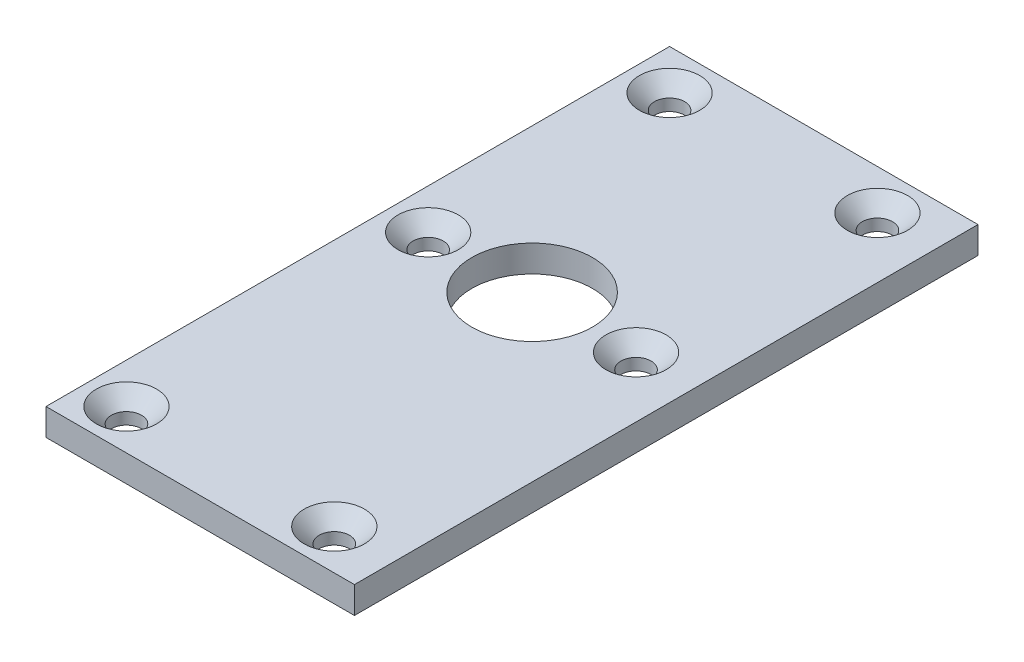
ISO-10303-21;
HEADER;
FILE_DESCRIPTION(('STEP AP214'),'2;1');
FILE_NAME('part.step','',(''),(''),'','','');
FILE_SCHEMA(('AUTOMOTIVE_DESIGN { 1 0 10303 214 1 1 1 1 }'));
ENDSEC;
DATA;
#1=APPLICATION_CONTEXT('core data for automotive mechanical design processes');
#2=APPLICATION_PROTOCOL_DEFINITION('international standard','automotive_design',2000,#1);
#3=PRODUCT_CONTEXT('',#1,'mechanical');
#4=PRODUCT('Part','Part','',(#3));
#5=PRODUCT_RELATED_PRODUCT_CATEGORY('part','',(#4));
#6=PRODUCT_DEFINITION_FORMATION('','',#4);
#7=PRODUCT_DEFINITION_CONTEXT('part definition',#1,'design');
#8=PRODUCT_DEFINITION('design','',#6,#7);
#9=PRODUCT_DEFINITION_SHAPE('','',#8);
#10=(LENGTH_UNIT() NAMED_UNIT(*) SI_UNIT(.MILLI.,.METRE.));
#11=(NAMED_UNIT(*) PLANE_ANGLE_UNIT() SI_UNIT($,.RADIAN.));
#12=(NAMED_UNIT(*) SI_UNIT($,.STERADIAN.) SOLID_ANGLE_UNIT());
#13=UNCERTAINTY_MEASURE_WITH_UNIT(LENGTH_MEASURE(1.E-05),#10,'distance_accuracy_value','');
#14=(GEOMETRIC_REPRESENTATION_CONTEXT(3) GLOBAL_UNCERTAINTY_ASSIGNED_CONTEXT((#13)) GLOBAL_UNIT_ASSIGNED_CONTEXT((#10,
#11,#12)) REPRESENTATION_CONTEXT('',''));
#15=CARTESIAN_POINT('',(0.,0.,0.));
#16=DIRECTION('',(0.,0.,1.));
#17=DIRECTION('',(1.,0.,0.));
#18=AXIS2_PLACEMENT_3D('',#15,#16,#17);
#19=CARTESIAN_POINT('',(-15.5,4.00000000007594,-40.5));
#20=DIRECTION('',(0.,1.,0.));
#21=DIRECTION('',(0.,0.,1.));
#22=AXIS2_PLACEMENT_3D('',#19,#20,#21);
#23=CONICAL_SURFACE('',#22,4.49999999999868,0.785398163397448);
#24=CARTESIAN_POINT('',(-15.5,1.75,-40.5));
#25=DIRECTION('',(0.,1.,0.));
#26=DIRECTION('',(0.,0.,1.));
#27=AXIS2_PLACEMENT_3D('',#24,#25,#26);
#28=CIRCLE('',#27,2.25);
#29=CARTESIAN_POINT('',(-15.5,1.75,-38.25));
#30=VERTEX_POINT('',#29);
#31=EDGE_CURVE('E96',#30,#30,#28,.F.);
#32=ORIENTED_EDGE('',*,*,#31,.T.);
#33=EDGE_LOOP('',(#32));
#34=FACE_BOUND('',#33,.T.);
#35=CARTESIAN_POINT('',(-15.5,4.00000000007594,-40.5));
#36=DIRECTION('',(0.,1.,0.));
#37=DIRECTION('',(0.,0.,1.));
#38=AXIS2_PLACEMENT_3D('',#35,#36,#37);
#39=CIRCLE('',#38,4.49999999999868);
#40=CARTESIAN_POINT('',(-15.5,4.00000000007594,-36.0000000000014));
#41=VERTEX_POINT('',#40);
#42=EDGE_CURVE('E20',#41,#41,#39,.F.);
#43=ORIENTED_EDGE('',*,*,#42,.F.);
#44=EDGE_LOOP('',(#43));
#45=FACE_BOUND('',#44,.T.);
#46=ADVANCED_FACE('F17',(#34,#45),#23,.F.);
#47=CARTESIAN_POINT('',(15.5000000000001,4.0000000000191,-40.5));
#48=DIRECTION('',(0.,1.,0.));
#49=DIRECTION('',(0.,0.,1.));
#50=AXIS2_PLACEMENT_3D('',#47,#48,#49);
#51=CONICAL_SURFACE('',#50,4.49999999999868,0.785398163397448);
#52=CARTESIAN_POINT('',(15.5000000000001,1.75,-40.5));
#53=DIRECTION('',(0.,1.,0.));
#54=DIRECTION('',(0.,0.,1.));
#55=AXIS2_PLACEMENT_3D('',#52,#53,#54);
#56=CIRCLE('',#55,2.25);
#57=CARTESIAN_POINT('',(15.5000000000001,1.75,-38.25));
#58=VERTEX_POINT('',#57);
#59=EDGE_CURVE('E93',#58,#58,#56,.F.);
#60=ORIENTED_EDGE('',*,*,#59,.T.);
#61=EDGE_LOOP('',(#60));
#62=FACE_BOUND('',#61,.T.);
#63=CARTESIAN_POINT('',(15.5000000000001,4.0000000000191,-40.5));
#64=DIRECTION('',(0.,1.,0.));
#65=DIRECTION('',(0.,0.,1.));
#66=AXIS2_PLACEMENT_3D('',#63,#64,#65);
#67=CIRCLE('',#66,4.49999999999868);
#68=CARTESIAN_POINT('',(15.5000000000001,4.0000000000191,-36.0000000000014));
#69=VERTEX_POINT('',#68);
#70=EDGE_CURVE('E135',#69,#69,#67,.F.);
#71=ORIENTED_EDGE('',*,*,#70,.F.);
#72=EDGE_LOOP('',(#71));
#73=FACE_BOUND('',#72,.T.);
#74=ADVANCED_FACE('F145',(#62,#73),#51,.F.);
#75=CARTESIAN_POINT('',(-15.5,4.00000000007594,-4.50000000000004));
#76=DIRECTION('',(0.,1.,0.));
#77=DIRECTION('',(0.,0.,1.));
#78=AXIS2_PLACEMENT_3D('',#75,#76,#77);
#79=CONICAL_SURFACE('',#78,4.50000000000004,0.785398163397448);
#80=CARTESIAN_POINT('',(-15.5,1.75,-4.50000000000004));
#81=DIRECTION('',(0.,1.,0.));
#82=DIRECTION('',(0.,0.,1.));
#83=AXIS2_PLACEMENT_3D('',#80,#81,#82);
#84=CIRCLE('',#83,2.24999999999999);
#85=CARTESIAN_POINT('',(-15.5,1.75,-2.25000000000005));
#86=VERTEX_POINT('',#85);
#87=EDGE_CURVE('E90',#86,#86,#84,.F.);
#88=ORIENTED_EDGE('',*,*,#87,.T.);
#89=EDGE_LOOP('',(#88));
#90=FACE_BOUND('',#89,.T.);
#91=CARTESIAN_POINT('',(-15.5,4.00000000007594,-4.50000000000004));
#92=DIRECTION('',(0.,1.,0.));
#93=DIRECTION('',(0.,0.,1.));
#94=AXIS2_PLACEMENT_3D('',#91,#92,#93);
#95=CIRCLE('',#94,4.50000000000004);
#96=CARTESIAN_POINT('',(-15.5,4.00000000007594,0.));
#97=VERTEX_POINT('',#96);
#98=EDGE_CURVE('E133',#97,#97,#95,.F.);
#99=ORIENTED_EDGE('',*,*,#98,.F.);
#100=EDGE_LOOP('',(#99));
#101=FACE_BOUND('',#100,.T.);
#102=ADVANCED_FACE('F151',(#90,#101),#79,.F.);
#103=CARTESIAN_POINT('',(15.5000000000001,4.00000000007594,-4.50000000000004));
#104=DIRECTION('',(0.,1.,0.));
#105=DIRECTION('',(0.,0.,1.));
#106=AXIS2_PLACEMENT_3D('',#103,#104,#105);
#107=CONICAL_SURFACE('',#106,4.50000000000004,0.785398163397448);
#108=CARTESIAN_POINT('',(15.5000000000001,1.75,-4.50000000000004));
#109=DIRECTION('',(0.,1.,0.));
#110=DIRECTION('',(0.,0.,1.));
#111=AXIS2_PLACEMENT_3D('',#108,#109,#110);
#112=CIRCLE('',#111,2.24999999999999);
#113=CARTESIAN_POINT('',(15.5000000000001,1.75,-2.25000000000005));
#114=VERTEX_POINT('',#113);
#115=EDGE_CURVE('E87',#114,#114,#112,.F.);
#116=ORIENTED_EDGE('',*,*,#115,.T.);
#117=EDGE_LOOP('',(#116));
#118=FACE_BOUND('',#117,.T.);
#119=CARTESIAN_POINT('',(15.5000000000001,4.00000000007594,-4.50000000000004));
#120=DIRECTION('',(0.,1.,0.));
#121=DIRECTION('',(0.,0.,1.));
#122=AXIS2_PLACEMENT_3D('',#119,#120,#121);
#123=CIRCLE('',#122,4.50000000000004);
#124=CARTESIAN_POINT('',(15.5000000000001,4.00000000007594,0.));
#125=VERTEX_POINT('',#124);
#126=EDGE_CURVE('E130',#125,#125,#123,.F.);
#127=ORIENTED_EDGE('',*,*,#126,.F.);
#128=EDGE_LOOP('',(#127));
#129=FACE_BOUND('',#128,.T.);
#130=ADVANCED_FACE('F210',(#118,#129),#107,.F.);
#131=CARTESIAN_POINT('',(-15.5,4.0000000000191,40.4999999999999));
#132=DIRECTION('',(0.,1.,0.));
#133=DIRECTION('',(0.,0.,1.));
#134=AXIS2_PLACEMENT_3D('',#131,#132,#133);
#135=CONICAL_SURFACE('',#134,4.49999999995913,0.785398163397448);
#136=CARTESIAN_POINT('',(-15.5,1.75,40.4999999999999));
#137=DIRECTION('',(0.,1.,0.));
#138=DIRECTION('',(0.,0.,1.));
#139=AXIS2_PLACEMENT_3D('',#136,#137,#138);
#140=CIRCLE('',#139,2.25);
#141=CARTESIAN_POINT('',(-15.5,1.75,42.7499999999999));
#142=VERTEX_POINT('',#141);
#143=EDGE_CURVE('E84',#142,#142,#140,.F.);
#144=ORIENTED_EDGE('',*,*,#143,.T.);
#145=EDGE_LOOP('',(#144));
#146=FACE_BOUND('',#145,.T.);
#147=CARTESIAN_POINT('',(-15.5,4.0000000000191,40.4999999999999));
#148=DIRECTION('',(0.,1.,0.));
#149=DIRECTION('',(0.,0.,1.));
#150=AXIS2_PLACEMENT_3D('',#147,#148,#149);
#151=CIRCLE('',#150,4.49999999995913);
#152=CARTESIAN_POINT('',(-15.5,4.0000000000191,44.9999999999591));
#153=VERTEX_POINT('',#152);
#154=EDGE_CURVE('E127',#153,#153,#151,.F.);
#155=ORIENTED_EDGE('',*,*,#154,.F.);
#156=EDGE_LOOP('',(#155));
#157=FACE_BOUND('',#156,.T.);
#158=ADVANCED_FACE('F206',(#146,#157),#135,.F.);
#159=CARTESIAN_POINT('',(15.5000000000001,4.0000000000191,40.4999999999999));
#160=DIRECTION('',(0.,1.,0.));
#161=DIRECTION('',(0.,0.,1.));
#162=AXIS2_PLACEMENT_3D('',#159,#160,#161);
#163=CONICAL_SURFACE('',#162,4.49999999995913,0.785398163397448);
#164=CARTESIAN_POINT('',(15.5000000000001,1.75,40.4999999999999));
#165=DIRECTION('',(0.,1.,0.));
#166=DIRECTION('',(0.,0.,1.));
#167=AXIS2_PLACEMENT_3D('',#164,#165,#166);
#168=CIRCLE('',#167,2.25);
#169=CARTESIAN_POINT('',(15.5000000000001,1.75,42.7499999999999));
#170=VERTEX_POINT('',#169);
#171=EDGE_CURVE('E67',#170,#170,#168,.F.);
#172=ORIENTED_EDGE('',*,*,#171,.T.);
#173=EDGE_LOOP('',(#172));
#174=FACE_BOUND('',#173,.T.);
#175=CARTESIAN_POINT('',(15.5000000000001,4.0000000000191,40.4999999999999));
#176=DIRECTION('',(0.,1.,0.));
#177=DIRECTION('',(0.,0.,1.));
#178=AXIS2_PLACEMENT_3D('',#175,#176,#177);
#179=CIRCLE('',#178,4.49999999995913);
#180=CARTESIAN_POINT('',(15.5000000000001,4.0000000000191,44.9999999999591));
#181=VERTEX_POINT('',#180);
#182=EDGE_CURVE('E124',#181,#181,#179,.F.);
#183=ORIENTED_EDGE('',*,*,#182,.F.);
#184=EDGE_LOOP('',(#183));
#185=FACE_BOUND('',#184,.T.);
#186=ADVANCED_FACE('F203',(#174,#185),#163,.F.);
#187=CARTESIAN_POINT('',(0.,4.,0.));
#188=DIRECTION('',(0.,1.,0.));
#189=DIRECTION('',(0.,0.,1.));
#190=AXIS2_PLACEMENT_3D('',#187,#188,#189);
#191=PLANE('',#190);
#192=DIRECTION('',(1.,0.,0.));
#193=VECTOR('',#192,1.);
#194=CARTESIAN_POINT('',(-21.5,4.,-46.5));
#195=LINE('',#194,#193);
#196=CARTESIAN_POINT('',(24.5,4.,-46.5));
#197=VERTEX_POINT('',#196);
#198=CARTESIAN_POINT('',(-21.5,4.,-46.5));
#199=VERTEX_POINT('',#198);
#200=EDGE_CURVE('E61',#197,#199,#195,.F.);
#201=ORIENTED_EDGE('',*,*,#200,.T.);
#202=DIRECTION('',(0.,0.,-1.));
#203=VECTOR('',#202,1.);
#204=CARTESIAN_POINT('',(-21.5,4.,-46.5));
#205=LINE('',#204,#203);
#206=CARTESIAN_POINT('',(-21.5,4.,46.5));
#207=VERTEX_POINT('',#206);
#208=EDGE_CURVE('E58',#199,#207,#205,.F.);
#209=ORIENTED_EDGE('',*,*,#208,.T.);
#210=DIRECTION('',(-1.,0.,0.));
#211=VECTOR('',#210,1.);
#212=CARTESIAN_POINT('',(-21.5,4.,46.5));
#213=LINE('',#212,#211);
#214=CARTESIAN_POINT('',(24.5,4.,46.5));
#215=VERTEX_POINT('',#214);
#216=EDGE_CURVE('E55',#207,#215,#213,.F.);
#217=ORIENTED_EDGE('',*,*,#216,.T.);
#218=DIRECTION('',(0.,0.,-1.));
#219=VECTOR('',#218,1.);
#220=CARTESIAN_POINT('',(24.5,4.,0.));
#221=LINE('',#220,#219);
#222=EDGE_CURVE('E374',#197,#215,#221,.F.);
#223=ORIENTED_EDGE('',*,*,#222,.F.);
#224=EDGE_LOOP('',(#201,#209,#217,#223));
#225=FACE_BOUND('',#224,.T.);
#226=ORIENTED_EDGE('',*,*,#182,.T.);
#227=EDGE_LOOP('',(#226));
#228=FACE_BOUND('',#227,.T.);
#229=ORIENTED_EDGE('',*,*,#154,.T.);
#230=EDGE_LOOP('',(#229));
#231=FACE_BOUND('',#230,.T.);
#232=ORIENTED_EDGE('',*,*,#126,.T.);
#233=EDGE_LOOP('',(#232));
#234=FACE_BOUND('',#233,.T.);
#235=ORIENTED_EDGE('',*,*,#98,.T.);
#236=EDGE_LOOP('',(#235));
#237=FACE_BOUND('',#236,.T.);
#238=ORIENTED_EDGE('',*,*,#70,.T.);
#239=EDGE_LOOP('',(#238));
#240=FACE_BOUND('',#239,.T.);
#241=ORIENTED_EDGE('',*,*,#42,.T.);
#242=EDGE_LOOP('',(#241));
#243=FACE_BOUND('',#242,.T.);
#244=CARTESIAN_POINT('',(1.11022302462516E-13,4.,-4.50000000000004));
#245=DIRECTION('',(0.,1.,0.));
#246=DIRECTION('',(0.,0.,1.));
#247=AXIS2_PLACEMENT_3D('',#244,#245,#246);
#248=CIRCLE('',#247,8.99999999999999);
#249=CARTESIAN_POINT('',(1.11022302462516E-13,4.,4.49999999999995));
#250=VERTEX_POINT('',#249);
#251=EDGE_CURVE('E99',#250,#250,#248,.F.);
#252=ORIENTED_EDGE('',*,*,#251,.T.);
#253=EDGE_LOOP('',(#252));
#254=FACE_BOUND('',#253,.T.);
#255=ADVANCED_FACE('F59',(#225,#228,#231,#234,#237,#240,#243,#254),#191,.T.);
#256=CARTESIAN_POINT('',(1.11022302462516E-13,0.,-4.50000000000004));
#257=DIRECTION('',(0.,1.,0.));
#258=DIRECTION('',(0.,0.,1.));
#259=AXIS2_PLACEMENT_3D('',#256,#257,#258);
#260=CYLINDRICAL_SURFACE('',#259,8.99999999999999);
#261=CARTESIAN_POINT('',(1.11022302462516E-13,0.,-4.50000000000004));
#262=DIRECTION('',(0.,1.,0.));
#263=DIRECTION('',(0.,0.,1.));
#264=AXIS2_PLACEMENT_3D('',#261,#262,#263);
#265=CIRCLE('',#264,8.99999999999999);
#266=CARTESIAN_POINT('',(1.11022302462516E-13,0.,4.49999999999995));
#267=VERTEX_POINT('',#266);
#268=EDGE_CURVE('E118',#267,#267,#265,.F.);
#269=ORIENTED_EDGE('',*,*,#268,.T.);
#270=EDGE_LOOP('',(#269));
#271=FACE_BOUND('',#270,.T.);
#272=ORIENTED_EDGE('',*,*,#251,.F.);
#273=EDGE_LOOP('',(#272));
#274=FACE_BOUND('',#273,.T.);
#275=ADVANCED_FACE('F196',(#271,#274),#260,.F.);
#276=CARTESIAN_POINT('',(-15.5,4.,-40.5));
#277=DIRECTION('',(0.,1.,0.));
#278=DIRECTION('',(0.,0.,1.));
#279=AXIS2_PLACEMENT_3D('',#276,#277,#278);
#280=CYLINDRICAL_SURFACE('',#279,2.25);
#281=CARTESIAN_POINT('',(-15.5,0.,-40.5));
#282=DIRECTION('',(0.,1.,0.));
#283=DIRECTION('',(0.,0.,1.));
#284=AXIS2_PLACEMENT_3D('',#281,#282,#283);
#285=CIRCLE('',#284,2.25);
#286=CARTESIAN_POINT('',(-15.5,0.,-38.25));
#287=VERTEX_POINT('',#286);
#288=EDGE_CURVE('E115',#287,#287,#285,.F.);
#289=ORIENTED_EDGE('',*,*,#288,.T.);
#290=EDGE_LOOP('',(#289));
#291=FACE_BOUND('',#290,.T.);
#292=ORIENTED_EDGE('',*,*,#31,.F.);
#293=EDGE_LOOP('',(#292));
#294=FACE_BOUND('',#293,.T.);
#295=ADVANCED_FACE('F192',(#291,#294),#280,.F.);
#296=CARTESIAN_POINT('',(15.5000000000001,4.,-40.5));
#297=DIRECTION('',(0.,1.,0.));
#298=DIRECTION('',(0.,0.,1.));
#299=AXIS2_PLACEMENT_3D('',#296,#297,#298);
#300=CYLINDRICAL_SURFACE('',#299,2.25);
#301=CARTESIAN_POINT('',(15.5000000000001,0.,-40.5));
#302=DIRECTION('',(0.,1.,0.));
#303=DIRECTION('',(0.,0.,1.));
#304=AXIS2_PLACEMENT_3D('',#301,#302,#303);
#305=CIRCLE('',#304,2.25);
#306=CARTESIAN_POINT('',(15.5000000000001,0.,-38.25));
#307=VERTEX_POINT('',#306);
#308=EDGE_CURVE('E112',#307,#307,#305,.F.);
#309=ORIENTED_EDGE('',*,*,#308,.T.);
#310=EDGE_LOOP('',(#309));
#311=FACE_BOUND('',#310,.T.);
#312=ORIENTED_EDGE('',*,*,#59,.F.);
#313=EDGE_LOOP('',(#312));
#314=FACE_BOUND('',#313,.T.);
#315=ADVANCED_FACE('F188',(#311,#314),#300,.F.);
#316=CARTESIAN_POINT('',(-15.5,4.,-4.50000000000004));
#317=DIRECTION('',(0.,1.,0.));
#318=DIRECTION('',(0.,0.,1.));
#319=AXIS2_PLACEMENT_3D('',#316,#317,#318);
#320=CYLINDRICAL_SURFACE('',#319,2.24999999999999);
#321=CARTESIAN_POINT('',(-15.5,0.,-4.50000000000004));
#322=DIRECTION('',(0.,1.,0.));
#323=DIRECTION('',(0.,0.,1.));
#324=AXIS2_PLACEMENT_3D('',#321,#322,#323);
#325=CIRCLE('',#324,2.24999999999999);
#326=CARTESIAN_POINT('',(-15.5,0.,-2.25000000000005));
#327=VERTEX_POINT('',#326);
#328=EDGE_CURVE('E109',#327,#327,#325,.F.);
#329=ORIENTED_EDGE('',*,*,#328,.T.);
#330=EDGE_LOOP('',(#329));
#331=FACE_BOUND('',#330,.T.);
#332=ORIENTED_EDGE('',*,*,#87,.F.);
#333=EDGE_LOOP('',(#332));
#334=FACE_BOUND('',#333,.T.);
#335=ADVANCED_FACE('F184',(#331,#334),#320,.F.);
#336=CARTESIAN_POINT('',(15.5000000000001,4.,-4.50000000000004));
#337=DIRECTION('',(0.,1.,0.));
#338=DIRECTION('',(0.,0.,1.));
#339=AXIS2_PLACEMENT_3D('',#336,#337,#338);
#340=CYLINDRICAL_SURFACE('',#339,2.24999999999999);
#341=CARTESIAN_POINT('',(15.5000000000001,0.,-4.50000000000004));
#342=DIRECTION('',(0.,1.,0.));
#343=DIRECTION('',(0.,0.,1.));
#344=AXIS2_PLACEMENT_3D('',#341,#342,#343);
#345=CIRCLE('',#344,2.24999999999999);
#346=CARTESIAN_POINT('',(15.5000000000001,0.,-2.25000000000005));
#347=VERTEX_POINT('',#346);
#348=EDGE_CURVE('E106',#347,#347,#345,.F.);
#349=ORIENTED_EDGE('',*,*,#348,.T.);
#350=EDGE_LOOP('',(#349));
#351=FACE_BOUND('',#350,.T.);
#352=ORIENTED_EDGE('',*,*,#115,.F.);
#353=EDGE_LOOP('',(#352));
#354=FACE_BOUND('',#353,.T.);
#355=ADVANCED_FACE('F180',(#351,#354),#340,.F.);
#356=CARTESIAN_POINT('',(-15.5,4.,40.4999999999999));
#357=DIRECTION('',(0.,1.,0.));
#358=DIRECTION('',(0.,0.,1.));
#359=AXIS2_PLACEMENT_3D('',#356,#357,#358);
#360=CYLINDRICAL_SURFACE('',#359,2.25);
#361=CARTESIAN_POINT('',(-15.5,0.,40.4999999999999));
#362=DIRECTION('',(0.,1.,0.));
#363=DIRECTION('',(0.,0.,1.));
#364=AXIS2_PLACEMENT_3D('',#361,#362,#363);
#365=CIRCLE('',#364,2.25);
#366=CARTESIAN_POINT('',(-15.5,0.,42.7499999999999));
#367=VERTEX_POINT('',#366);
#368=EDGE_CURVE('E103',#367,#367,#365,.F.);
#369=ORIENTED_EDGE('',*,*,#368,.T.);
#370=EDGE_LOOP('',(#369));
#371=FACE_BOUND('',#370,.T.);
#372=ORIENTED_EDGE('',*,*,#143,.F.);
#373=EDGE_LOOP('',(#372));
#374=FACE_BOUND('',#373,.T.);
#375=ADVANCED_FACE('F176',(#371,#374),#360,.F.);
#376=CARTESIAN_POINT('',(15.5000000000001,4.,40.4999999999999));
#377=DIRECTION('',(0.,1.,0.));
#378=DIRECTION('',(0.,0.,1.));
#379=AXIS2_PLACEMENT_3D('',#376,#377,#378);
#380=CYLINDRICAL_SURFACE('',#379,2.25);
#381=CARTESIAN_POINT('',(15.5000000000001,0.,40.4999999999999));
#382=DIRECTION('',(0.,1.,0.));
#383=DIRECTION('',(0.,0.,1.));
#384=AXIS2_PLACEMENT_3D('',#381,#382,#383);
#385=CIRCLE('',#384,2.25);
#386=CARTESIAN_POINT('',(15.5000000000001,0.,42.7499999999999));
#387=VERTEX_POINT('',#386);
#388=EDGE_CURVE('E100',#387,#387,#385,.F.);
#389=ORIENTED_EDGE('',*,*,#388,.T.);
#390=EDGE_LOOP('',(#389));
#391=FACE_BOUND('',#390,.T.);
#392=ORIENTED_EDGE('',*,*,#171,.F.);
#393=EDGE_LOOP('',(#392));
#394=FACE_BOUND('',#393,.T.);
#395=ADVANCED_FACE('F173',(#391,#394),#380,.F.);
#396=CARTESIAN_POINT('',(-21.5,4.,-46.5));
#397=DIRECTION('',(1.,0.,0.));
#398=DIRECTION('',(0.,0.,-1.));
#399=AXIS2_PLACEMENT_3D('',#396,#397,#398);
#400=PLANE('',#399);
#401=DIRECTION('',(0.,1.,0.));
#402=VECTOR('',#401,1.);
#403=CARTESIAN_POINT('',(-21.5,4.,46.5));
#404=LINE('',#403,#402);
#405=CARTESIAN_POINT('',(-21.5,0.,46.5));
#406=VERTEX_POINT('',#405);
#407=EDGE_CURVE('E66',#406,#207,#404,.T.);
#408=ORIENTED_EDGE('',*,*,#407,.T.);
#409=ORIENTED_EDGE('',*,*,#208,.F.);
#410=DIRECTION('',(0.,1.,0.));
#411=VECTOR('',#410,1.);
#412=CARTESIAN_POINT('',(-21.5,4.,-46.5));
#413=LINE('',#412,#411);
#414=CARTESIAN_POINT('',(-21.5,0.,-46.5));
#415=VERTEX_POINT('',#414);
#416=EDGE_CURVE('E121',#199,#415,#413,.F.);
#417=ORIENTED_EDGE('',*,*,#416,.T.);
#418=DIRECTION('',(0.,0.,1.));
#419=VECTOR('',#418,1.);
#420=CARTESIAN_POINT('',(-21.5,0.,0.));
#421=LINE('',#420,#419);
#422=EDGE_CURVE('E78',#415,#406,#421,.T.);
#423=ORIENTED_EDGE('',*,*,#422,.T.);
#424=EDGE_LOOP('',(#408,#409,#417,#423));
#425=FACE_BOUND('',#424,.T.);
#426=ADVANCED_FACE('F77',(#425),#400,.F.);
#427=CARTESIAN_POINT('',(-21.5,4.,46.5));
#428=DIRECTION('',(0.,0.,-1.));
#429=DIRECTION('',(-1.,0.,0.));
#430=AXIS2_PLACEMENT_3D('',#427,#428,#429);
#431=PLANE('',#430);
#432=DIRECTION('',(0.,1.,0.));
#433=VECTOR('',#432,1.);
#434=CARTESIAN_POINT('',(24.5,0.,46.5));
#435=LINE('',#434,#433);
#436=CARTESIAN_POINT('',(24.5,0.,46.5));
#437=VERTEX_POINT('',#436);
#438=EDGE_CURVE('E74',#215,#437,#435,.F.);
#439=ORIENTED_EDGE('',*,*,#438,.F.);
#440=ORIENTED_EDGE('',*,*,#216,.F.);
#441=ORIENTED_EDGE('',*,*,#407,.F.);
#442=DIRECTION('',(1.,0.,0.));
#443=VECTOR('',#442,1.);
#444=CARTESIAN_POINT('',(0.,0.,46.5));
#445=LINE('',#444,#443);
#446=EDGE_CURVE('E379',#406,#437,#445,.T.);
#447=ORIENTED_EDGE('',*,*,#446,.T.);
#448=EDGE_LOOP('',(#439,#440,#441,#447));
#449=FACE_BOUND('',#448,.T.);
#450=ADVANCED_FACE('F71',(#449),#431,.F.);
#451=CARTESIAN_POINT('',(24.5,0.,0.));
#452=DIRECTION('',(1.,0.,0.));
#453=DIRECTION('',(0.,0.,-1.));
#454=AXIS2_PLACEMENT_3D('',#451,#452,#453);
#455=PLANE('',#454);
#456=DIRECTION('',(0.,1.,0.));
#457=VECTOR('',#456,1.);
#458=CARTESIAN_POINT('',(24.5,4.,-46.5));
#459=LINE('',#458,#457);
#460=CARTESIAN_POINT('',(24.5,0.,-46.5));
#461=VERTEX_POINT('',#460);
#462=EDGE_CURVE('E34',#461,#197,#459,.T.);
#463=ORIENTED_EDGE('',*,*,#462,.T.);
#464=ORIENTED_EDGE('',*,*,#222,.T.);
#465=ORIENTED_EDGE('',*,*,#438,.T.);
#466=DIRECTION('',(0.,0.,1.));
#467=VECTOR('',#466,1.);
#468=CARTESIAN_POINT('',(24.5,0.,0.));
#469=LINE('',#468,#467);
#470=EDGE_CURVE('E26',#437,#461,#469,.F.);
#471=ORIENTED_EDGE('',*,*,#470,.T.);
#472=EDGE_LOOP('',(#463,#464,#465,#471));
#473=FACE_BOUND('',#472,.T.);
#474=ADVANCED_FACE('F161',(#473),#455,.T.);
#475=CARTESIAN_POINT('',(-21.5,4.,-46.5));
#476=DIRECTION('',(0.,0.,1.));
#477=DIRECTION('',(1.,0.,0.));
#478=AXIS2_PLACEMENT_3D('',#475,#476,#477);
#479=PLANE('',#478);
#480=ORIENTED_EDGE('',*,*,#416,.F.);
#481=ORIENTED_EDGE('',*,*,#200,.F.);
#482=ORIENTED_EDGE('',*,*,#462,.F.);
#483=DIRECTION('',(1.,0.,0.));
#484=VECTOR('',#483,1.);
#485=CARTESIAN_POINT('',(0.,0.,-46.5));
#486=LINE('',#485,#484);
#487=EDGE_CURVE('E11',#461,#415,#486,.F.);
#488=ORIENTED_EDGE('',*,*,#487,.T.);
#489=EDGE_LOOP('',(#480,#481,#482,#488));
#490=FACE_BOUND('',#489,.T.);
#491=ADVANCED_FACE('F155',(#490),#479,.F.);
#492=CARTESIAN_POINT('',(0.,0.,0.));
#493=DIRECTION('',(0.,1.,0.));
#494=DIRECTION('',(0.,0.,1.));
#495=AXIS2_PLACEMENT_3D('',#492,#493,#494);
#496=PLANE('',#495);
#497=ORIENTED_EDGE('',*,*,#470,.F.);
#498=ORIENTED_EDGE('',*,*,#446,.F.);
#499=ORIENTED_EDGE('',*,*,#422,.F.);
#500=ORIENTED_EDGE('',*,*,#487,.F.);
#501=EDGE_LOOP('',(#497,#498,#499,#500));
#502=FACE_BOUND('',#501,.T.);
#503=ORIENTED_EDGE('',*,*,#388,.F.);
#504=EDGE_LOOP('',(#503));
#505=FACE_BOUND('',#504,.T.);
#506=ORIENTED_EDGE('',*,*,#368,.F.);
#507=EDGE_LOOP('',(#506));
#508=FACE_BOUND('',#507,.T.);
#509=ORIENTED_EDGE('',*,*,#348,.F.);
#510=EDGE_LOOP('',(#509));
#511=FACE_BOUND('',#510,.T.);
#512=ORIENTED_EDGE('',*,*,#328,.F.);
#513=EDGE_LOOP('',(#512));
#514=FACE_BOUND('',#513,.T.);
#515=ORIENTED_EDGE('',*,*,#308,.F.);
#516=EDGE_LOOP('',(#515));
#517=FACE_BOUND('',#516,.T.);
#518=ORIENTED_EDGE('',*,*,#288,.F.);
#519=EDGE_LOOP('',(#518));
#520=FACE_BOUND('',#519,.T.);
#521=ORIENTED_EDGE('',*,*,#268,.F.);
#522=EDGE_LOOP('',(#521));
#523=FACE_BOUND('',#522,.T.);
#524=ADVANCED_FACE('F153',(#502,#505,#508,#511,#514,#517,#520,#523),#496,.F.);
#525=CLOSED_SHELL('',(#46,#74,#102,#130,#158,#186,#255,#275,#295,#315,#335,#355,#375,#395,#426,
#450,#474,#491,#524));
#526=MANIFOLD_SOLID_BREP('B1',#525);
#527=ADVANCED_BREP_SHAPE_REPRESENTATION('',(#18,#526),#14);
#528=SHAPE_DEFINITION_REPRESENTATION(#9,#527);
ENDSEC;
END-ISO-10303-21;
